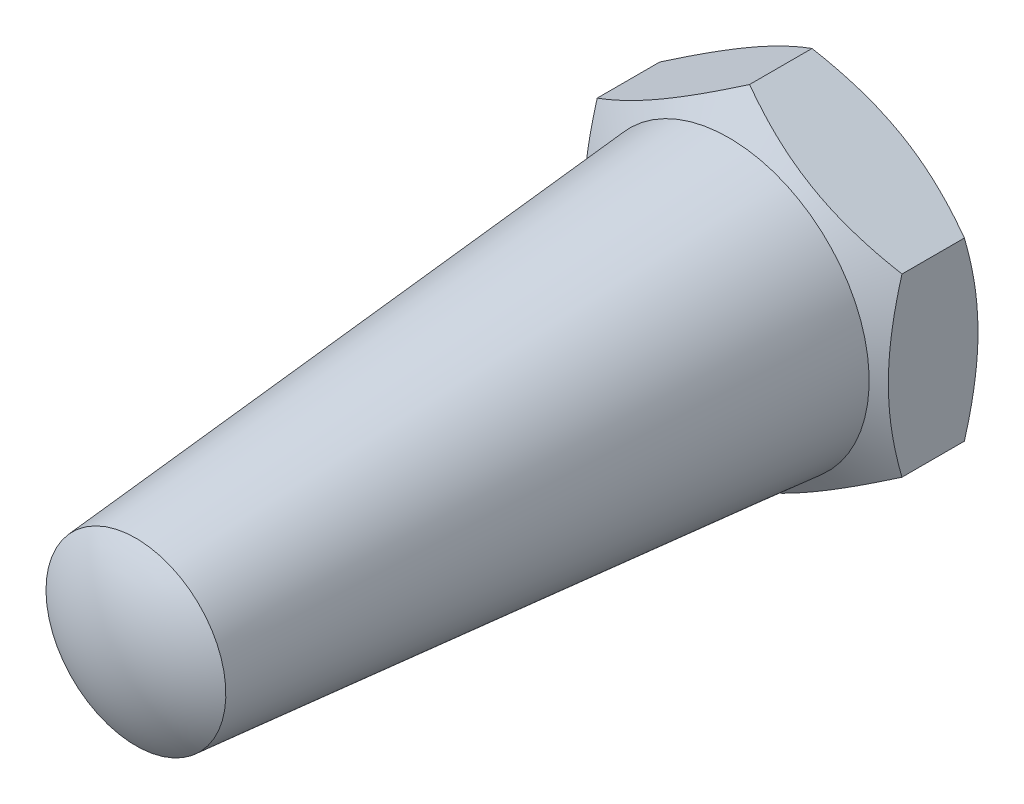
ISO-10303-21;
HEADER;
FILE_DESCRIPTION(('STEP AP214'),'2;1');
FILE_NAME('part.step','',(''),(''),'','','');
FILE_SCHEMA(('AUTOMOTIVE_DESIGN { 1 0 10303 214 1 1 1 1 }'));
ENDSEC;
DATA;
#1=APPLICATION_CONTEXT('core data for automotive mechanical design processes');
#2=APPLICATION_PROTOCOL_DEFINITION('international standard','automotive_design',2000,#1);
#3=PRODUCT_CONTEXT('',#1,'mechanical');
#4=PRODUCT('Part','Part','',(#3));
#5=PRODUCT_RELATED_PRODUCT_CATEGORY('part','',(#4));
#6=PRODUCT_DEFINITION_FORMATION('','',#4);
#7=PRODUCT_DEFINITION_CONTEXT('part definition',#1,'design');
#8=PRODUCT_DEFINITION('design','',#6,#7);
#9=PRODUCT_DEFINITION_SHAPE('','',#8);
#10=(LENGTH_UNIT() NAMED_UNIT(*) SI_UNIT(.MILLI.,.METRE.));
#11=(NAMED_UNIT(*) PLANE_ANGLE_UNIT() SI_UNIT($,.RADIAN.));
#12=(NAMED_UNIT(*) SI_UNIT($,.STERADIAN.) SOLID_ANGLE_UNIT());
#13=UNCERTAINTY_MEASURE_WITH_UNIT(LENGTH_MEASURE(1.E-05),#10,'distance_accuracy_value','');
#14=(GEOMETRIC_REPRESENTATION_CONTEXT(3) GLOBAL_UNCERTAINTY_ASSIGNED_CONTEXT((#13)) GLOBAL_UNIT_ASSIGNED_CONTEXT((#10,
#11,#12)) REPRESENTATION_CONTEXT('',''));
#15=CARTESIAN_POINT('',(0.,0.,0.));
#16=DIRECTION('',(0.,0.,1.));
#17=DIRECTION('',(1.,0.,0.));
#18=AXIS2_PLACEMENT_3D('',#15,#16,#17);
#19=CARTESIAN_POINT('',(0.,0.,0.));
#20=DIRECTION('',(0.,0.,1.));
#21=DIRECTION('',(-0.5,-0.866025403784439,0.));
#22=AXIS2_PLACEMENT_3D('',#19,#20,#21);
#23=CONICAL_SURFACE('',#22,8.5,1.04719755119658);
#24=CARTESIAN_POINT('',(-8.5,-4.90770822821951,0.759256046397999));
#25=CARTESIAN_POINT('',(-8.5,-4.69196487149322,0.696986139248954));
#26=CARTESIAN_POINT('',(-8.5,-4.47541714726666,0.637542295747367));
#27=CARTESIAN_POINT('',(-8.5,-4.04056304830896,0.52508511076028));
#28=CARTESIAN_POINT('',(-8.5,-3.82225595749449,0.472074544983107));
#29=CARTESIAN_POINT('',(-8.5,-3.1638393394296,0.32373338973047));
#30=CARTESIAN_POINT('',(-8.5,-2.72113075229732,0.239358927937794));
#31=CARTESIAN_POINT('',(-8.5,-2.05862591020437,0.140420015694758));
#32=CARTESIAN_POINT('',(-8.5,-1.84080885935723,0.112235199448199));
#33=CARTESIAN_POINT('',(-8.5,-1.40418973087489,0.0649740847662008));
#34=CARTESIAN_POINT('',(-8.5,-1.18538774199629,0.0458969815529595));
#35=CARTESIAN_POINT('',(-8.5,-0.747407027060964,0.0173347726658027));
#36=CARTESIAN_POINT('',(-8.5,-0.52822901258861,0.00783878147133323));
#37=CARTESIAN_POINT('',(-8.5,-0.0896705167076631,-0.00135762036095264));
#38=CARTESIAN_POINT('',(-8.5,0.129709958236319,-0.00105833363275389));
#39=CARTESIAN_POINT('',(-8.5,0.539849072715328,0.00865447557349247));
#40=CARTESIAN_POINT('',(-8.5,0.730636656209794,0.0168831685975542));
#41=CARTESIAN_POINT('',(-8.5,1.11176497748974,0.0405892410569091));
#42=CARTESIAN_POINT('',(-8.5,1.30210568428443,0.0560671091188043));
#43=CARTESIAN_POINT('',(-8.5,1.87239091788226,0.113008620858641));
#44=CARTESIAN_POINT('',(-8.5,2.25132599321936,0.164973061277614));
#45=CARTESIAN_POINT('',(-8.5,3.01321579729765,0.294884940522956));
#46=CARTESIAN_POINT('',(-8.5,3.39607329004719,0.373383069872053));
#47=CARTESIAN_POINT('',(-8.5,4.15607888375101,0.551541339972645));
#48=CARTESIAN_POINT('',(-8.5,4.53323671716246,0.651159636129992));
#49=CARTESIAN_POINT('',(-8.5,4.90770822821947,0.759256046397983));
#50=B_SPLINE_CURVE_WITH_KNOTS('',3,(#24,#25,#26,#27,#28,#29,#30,#31,#32,#33,#34,#35,#36,#37,#38,
#39,#40,#41,#42,#43,#44,#45,#46,#47,#48,#49),.UNSPECIFIED.,.F.,.F.,(4,2,2,2,2,2,2,2,2,2,2,2,4),
(0.,0.673596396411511,1.34748239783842,2.69805431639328,3.35679995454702,4.01548737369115,
4.67342558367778,5.33134346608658,5.90409556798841,6.47688628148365,7.62328361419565,
8.79510569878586,9.9646274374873),.UNSPECIFIED.);
#51=CARTESIAN_POINT('',(-8.5,0.,0.));
#52=VERTEX_POINT('',#51);
#53=CARTESIAN_POINT('',(-8.5,4.9074772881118,0.75918937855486));
#54=VERTEX_POINT('',#53);
#55=EDGE_CURVE('E144',#52,#54,#50,.T.);
#56=ORIENTED_EDGE('',*,*,#55,.T.);
#57=CARTESIAN_POINT('',(-8.5002,4.90736181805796,0.759256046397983));
#58=CARTESIAN_POINT('',(-8.31336077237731,5.01523349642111,0.696986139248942));
#59=CARTESIAN_POINT('',(-8.1258249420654,5.12350735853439,0.637542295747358));
#60=CARTESIAN_POINT('',(-7.74923024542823,5.34093440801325,0.525085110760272));
#61=CARTESIAN_POINT('',(-7.56017075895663,5.45008795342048,0.472074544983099));
#62=CARTESIAN_POINT('',(-6.98996524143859,5.77929626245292,0.32373338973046));
#63=CARTESIAN_POINT('',(-6.60656835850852,6.00065055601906,0.239358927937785));
#64=CARTESIAN_POINT('',(-6.03282233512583,6.33190297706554,0.140420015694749));
#65=CARTESIAN_POINT('',(-5.8441872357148,6.44081150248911,0.112235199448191));
#66=CARTESIAN_POINT('',(-5.46606397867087,6.65912106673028,0.0649740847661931));
#67=CARTESIAN_POINT('',(-5.27657589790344,6.76852206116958,0.0458969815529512));
#68=CARTESIAN_POINT('',(-4.89727347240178,6.98751241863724,0.0173347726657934));
#69=CARTESIAN_POINT('',(-4.70745974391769,7.09710142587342,0.00783878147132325));
#70=CARTESIAN_POINT('',(-4.32765694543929,7.31638067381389,-0.00135762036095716));
#71=CARTESIAN_POINT('',(-4.1376678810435,7.42607091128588,-0.00105833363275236));
#72=CARTESIAN_POINT('',(-3.78247698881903,7.63114046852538,0.00865447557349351));
#73=CARTESIAN_POINT('',(-3.61725009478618,7.72653426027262,0.0168831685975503));
#74=CARTESIAN_POINT('',(-3.28718328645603,7.9170984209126,0.0405892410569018));
#75=CARTESIAN_POINT('',(-3.12234339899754,8.01226877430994,0.0560671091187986));
#76=CARTESIAN_POINT('',(-2.62846189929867,8.29741139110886,0.113008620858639));
#77=CARTESIAN_POINT('',(-2.30029449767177,8.48687892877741,0.164973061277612));
#78=CARTESIAN_POINT('',(-1.64047857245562,8.86782383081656,0.294884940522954));
#79=CARTESIAN_POINT('',(-1.3089142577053,9.05925257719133,0.37338306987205));
#80=CARTESIAN_POINT('',(-0.650730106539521,9.43925537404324,0.551541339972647));
#81=CARTESIAN_POINT('',(-0.324101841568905,9.62783429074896,0.651159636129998));
#82=CARTESIAN_POINT('',(0.00020000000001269,9.81507004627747,0.759256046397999));
#83=B_SPLINE_CURVE_WITH_KNOTS('',3,(#57,#58,#59,#60,#61,#62,#63,#64,#65,#66,#67,#68,#69,#70,#71,
#72,#73,#74,#75,#76,#77,#78,#79,#80,#81,#82),.UNSPECIFIED.,.F.,.F.,(4,2,2,2,2,2,2,2,2,2,2,2,4),
(0.,0.673596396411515,1.34748239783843,2.69805431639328,3.35679995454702,4.01548737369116,
4.67342558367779,5.33134346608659,5.90409556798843,6.47688628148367,7.62328361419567,
8.79510569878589,9.96462743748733),.UNSPECIFIED.);
#84=CARTESIAN_POINT('',(-4.25,7.36121593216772,0.));
#85=VERTEX_POINT('',#84);
#86=EDGE_CURVE('E96',#54,#85,#83,.T.);
#87=ORIENTED_EDGE('',*,*,#86,.T.);
#88=CARTESIAN_POINT('',(0.,0.,0.));
#89=DIRECTION('',(0.,0.,-1.));
#90=DIRECTION('',(0.5,0.866025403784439,0.));
#91=AXIS2_PLACEMENT_3D('',#88,#89,#90);
#92=CIRCLE('',#91,8.5);
#93=EDGE_CURVE('E107',#52,#85,#92,.T.);
#94=ORIENTED_EDGE('',*,*,#93,.F.);
#95=EDGE_LOOP('',(#56,#87,#94));
#96=FACE_BOUND('',#95,.T.);
#97=ADVANCED_FACE('F14',(#96),#23,.T.);
#98=CARTESIAN_POINT('',(4.25,7.36121593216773,0.));
#99=VERTEX_POINT('',#98);
#100=EDGE_CURVE('E104',#85,#99,#92,.T.);
#101=ORIENTED_EDGE('',*,*,#100,.F.);
#102=CARTESIAN_POINT('',(0.,9.81495457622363,0.759189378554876));
#103=VERTEX_POINT('',#102);
#104=EDGE_CURVE('E110',#85,#103,#83,.T.);
#105=ORIENTED_EDGE('',*,*,#104,.T.);
#106=CARTESIAN_POINT('',(-7.23207771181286,13.9903965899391,4.18526972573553));
#107=CARTESIAN_POINT('',(-6.91001284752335,13.804452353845,4.00456511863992));
#108=CARTESIAN_POINT('',(-6.58721574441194,13.61808535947,3.82557120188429));
#109=CARTESIAN_POINT('',(-5.93976791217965,13.2442811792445,3.47196532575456));
#110=CARTESIAN_POINT('',(-5.61511690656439,13.0568438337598,3.29735404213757));
#111=CARTESIAN_POINT('',(-4.96193081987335,12.6797266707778,2.95261175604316));
#112=CARTESIAN_POINT('',(-4.63338425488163,12.4900402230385,2.7825096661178));
#113=CARTESIAN_POINT('',(-3.97370116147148,12.1091720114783,2.44916508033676));
#114=CARTESIAN_POINT('',(-3.6425647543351,11.9179903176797,2.28592226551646));
#115=CARTESIAN_POINT('',(-2.96621852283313,11.5275016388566,1.96287121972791));
#116=CARTESIAN_POINT('',(-2.6209042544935,11.3281343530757,1.80335295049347));
#117=CARTESIAN_POINT('',(-1.92626102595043,10.9270818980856,1.49620558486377));
#118=CARTESIAN_POINT('',(-1.57693162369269,10.7253964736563,1.34857781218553));
#119=CARTESIAN_POINT('',(-0.874330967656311,10.3197497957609,1.06903165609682));
#120=CARTESIAN_POINT('',(-0.521069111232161,10.11579396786,0.937082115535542));
#121=CARTESIAN_POINT('',(0.19050935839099,9.70496394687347,0.693074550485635));
#122=CARTESIAN_POINT('',(0.548824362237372,9.49809068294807,0.581010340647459));
#123=CARTESIAN_POINT('',(1.26876054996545,9.08243533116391,0.382710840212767));
#124=CARTESIAN_POINT('',(1.63035127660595,8.87367082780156,0.296332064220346));
#125=CARTESIAN_POINT('',(2.17608252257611,8.5585927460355,0.189725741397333));
#126=CARTESIAN_POINT('',(2.35856341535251,8.45323735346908,0.158015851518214));
#127=CARTESIAN_POINT('',(2.72445452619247,8.24199002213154,0.102870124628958));
#128=CARTESIAN_POINT('',(2.90786465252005,8.13609813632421,0.0794334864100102));
#129=CARTESIAN_POINT('',(3.27294381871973,7.9253195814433,0.0415991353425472));
#130=CARTESIAN_POINT('',(3.45460386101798,7.8204381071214,0.0270861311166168));
#131=CARTESIAN_POINT('',(3.81829287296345,7.61046215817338,0.00694756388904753));
#132=CARTESIAN_POINT('',(4.00032183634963,7.50536768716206,0.00132185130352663));
#133=CARTESIAN_POINT('',(4.36442256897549,7.29515403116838,-0.000907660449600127));
#134=CARTESIAN_POINT('',(4.54649433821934,7.19003484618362,0.00248854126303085));
#135=CARTESIAN_POINT('',(4.91035029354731,6.97996251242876,0.0182187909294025));
#136=CARTESIAN_POINT('',(5.09213446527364,6.87500937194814,0.0305532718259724));
#137=CARTESIAN_POINT('',(5.52703745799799,6.62391801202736,0.070491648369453));
#138=CARTESIAN_POINT('',(5.77987910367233,6.47793981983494,0.102209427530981));
#139=CARTESIAN_POINT('',(6.28371702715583,6.18704885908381,0.181223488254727));
#140=CARTESIAN_POINT('',(6.5347130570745,6.04213623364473,0.22852182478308));
#141=CARTESIAN_POINT('',(7.28462915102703,5.6091719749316,0.391282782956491));
#142=CARTESIAN_POINT('',(7.78020394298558,5.32305173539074,0.527582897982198));
#143=CARTESIAN_POINT('',(8.52128703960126,4.8951872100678,0.76439975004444));
#144=CARTESIAN_POINT('',(8.77062907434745,4.7512295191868,0.849844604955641));
#145=CARTESIAN_POINT('',(9.26689247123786,4.46471171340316,1.02972598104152));
#146=CARTESIAN_POINT('',(9.51381381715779,4.32215160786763,1.1241625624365));
#147=CARTESIAN_POINT('',(10.0053112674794,4.03838542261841,1.32050253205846));
#148=CARTESIAN_POINT('',(10.2498880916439,3.89717892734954,1.42240353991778));
#149=CARTESIAN_POINT('',(10.7370088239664,3.61593964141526,1.63246178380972));
#150=CARTESIAN_POINT('',(10.9795527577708,3.47590683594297,1.74061894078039));
#151=CARTESIAN_POINT('',(11.5588292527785,3.14146139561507,2.00615790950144));
#152=CARTESIAN_POINT('',(11.8947051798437,2.94754333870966,2.16602701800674));
#153=CARTESIAN_POINT('',(12.5635309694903,2.56139658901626,2.49375196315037));
#154=CARTESIAN_POINT('',(12.8964806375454,2.36916800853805,2.66160832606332));
#155=CARTESIAN_POINT('',(13.5600092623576,1.9860795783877,3.00368299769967));
#156=CARTESIAN_POINT('',(13.890587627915,1.79522007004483,3.17790283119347));
#157=CARTESIAN_POINT('',(14.5496956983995,1.41468384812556,3.53139949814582));
#158=CARTESIAN_POINT('',(14.8782254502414,1.22500710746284,3.71067621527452));
#159=CARTESIAN_POINT('',(15.5339610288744,0.846417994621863,4.07353479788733));
#160=CARTESIAN_POINT('',(15.8611648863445,0.657506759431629,4.2571214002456));
#161=CARTESIAN_POINT('',(16.5141402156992,0.280511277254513,4.62765894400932));
#162=CARTESIAN_POINT('',(16.8399116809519,0.0924270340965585,4.81460990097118));
#163=CARTESIAN_POINT('',(17.8153349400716,-0.47073384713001,5.37954999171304));
#164=CARTESIAN_POINT('',(18.4631885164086,-0.844772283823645,5.76167820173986));
#165=CARTESIAN_POINT('',(19.6998458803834,-1.55875674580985,6.50045352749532));
#166=CARTESIAN_POINT('',(20.2889356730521,-1.89886789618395,6.85646521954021));
#167=CARTESIAN_POINT('',(21.4649231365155,-2.57782457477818,7.57334253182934));
#168=CARTESIAN_POINT('',(22.0518207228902,-2.91667005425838,7.9342083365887));
#169=CARTESIAN_POINT('',(23.2223733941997,-3.59248895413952,8.65867559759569));
#170=CARTESIAN_POINT('',(23.8060329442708,-3.92946495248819,9.02226745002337));
#171=CARTESIAN_POINT('',(24.9719543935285,-4.60261001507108,9.75233522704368));
#172=CARTESIAN_POINT('',(25.554216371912,-4.93877912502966,10.1188109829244));
#173=CARTESIAN_POINT('',(26.1359662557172,-5.27465257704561,10.4863601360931));
#174=B_SPLINE_CURVE_WITH_KNOTS('',3,(#106,#107,#108,#109,#110,#111,#112,#113,#114,#115,#116,
#117,#118,#119,#120,#121,#122,#123,#124,#125,#126,#127,#128,#129,#130,#131,#132,#133,#134,#135,
#136,#137,#138,#139,#140,#141,#142,#143,#144,#145,#146,#147,#148,#149,#150,#151,#152,#153,#154,
#155,#156,#157,#158,#159,#160,#161,#162,#163,#164,#165,#166,#167,#168,#169,#170,#171,#172,#173),
.UNSPECIFIED.,.F.,.F.,(4,2,2,2,2,2,2,2,2,2,2,2,2,2,2,2,2,2,2,2,2,2,2,2,2,2,2,2,2,2,2,2,2,4),(0.,
1.24041661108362,2.4810233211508,3.72825657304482,4.97543176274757,6.26366261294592,
7.55203667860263,8.83780596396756,10.1231746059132,11.4012218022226,12.0403353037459,
12.6793868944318,13.3099983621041,13.9405992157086,14.5712001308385,15.2018315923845,
16.0823582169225,16.9630010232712,18.725232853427,19.6261358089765,20.5270447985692,
21.4276677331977,22.3282792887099,23.586638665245,24.8450810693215,26.1038270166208,
27.3625440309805,28.6227160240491,29.8828938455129,32.402892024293,34.7061342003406,
37.0094641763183,39.306779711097,41.6039618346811),.UNSPECIFIED.);
#175=EDGE_CURVE('E182',#103,#99,#174,.T.);
#176=ORIENTED_EDGE('',*,*,#175,.T.);
#177=EDGE_LOOP('',(#101,#105,#176));
#178=FACE_BOUND('',#177,.T.);
#179=ADVANCED_FACE('F139',(#178),#23,.T.);
#180=CARTESIAN_POINT('',(8.5,0.,0.));
#181=VERTEX_POINT('',#180);
#182=EDGE_CURVE('E109',#99,#181,#92,.T.);
#183=ORIENTED_EDGE('',*,*,#182,.F.);
#184=CARTESIAN_POINT('',(8.5,4.90747728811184,0.759189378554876));
#185=VERTEX_POINT('',#184);
#186=EDGE_CURVE('E175',#99,#185,#174,.T.);
#187=ORIENTED_EDGE('',*,*,#186,.T.);
#188=CARTESIAN_POINT('',(8.5,4.90770822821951,0.759256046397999));
#189=CARTESIAN_POINT('',(8.5,4.69196487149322,0.696986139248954));
#190=CARTESIAN_POINT('',(8.5,4.47541714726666,0.637542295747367));
#191=CARTESIAN_POINT('',(8.5,4.04056304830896,0.52508511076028));
#192=CARTESIAN_POINT('',(8.5,3.82225595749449,0.472074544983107));
#193=CARTESIAN_POINT('',(8.5,3.1638393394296,0.32373338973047));
#194=CARTESIAN_POINT('',(8.5,2.72113075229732,0.239358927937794));
#195=CARTESIAN_POINT('',(8.5,2.05862591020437,0.140420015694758));
#196=CARTESIAN_POINT('',(8.5,1.84080885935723,0.112235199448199));
#197=CARTESIAN_POINT('',(8.5,1.40418973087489,0.0649740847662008));
#198=CARTESIAN_POINT('',(8.5,1.18538774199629,0.0458969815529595));
#199=CARTESIAN_POINT('',(8.5,0.747407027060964,0.0173347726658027));
#200=CARTESIAN_POINT('',(8.5,0.52822901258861,0.00783878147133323));
#201=CARTESIAN_POINT('',(8.5,0.0896705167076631,-0.00135762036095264));
#202=CARTESIAN_POINT('',(8.5,-0.129709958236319,-0.00105833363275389));
#203=CARTESIAN_POINT('',(8.5,-0.539849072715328,0.00865447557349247));
#204=CARTESIAN_POINT('',(8.5,-0.730636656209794,0.0168831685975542));
#205=CARTESIAN_POINT('',(8.5,-1.11176497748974,0.0405892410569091));
#206=CARTESIAN_POINT('',(8.5,-1.30210568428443,0.0560671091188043));
#207=CARTESIAN_POINT('',(8.5,-1.87239091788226,0.113008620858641));
#208=CARTESIAN_POINT('',(8.5,-2.25132599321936,0.164973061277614));
#209=CARTESIAN_POINT('',(8.5,-3.01321579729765,0.294884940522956));
#210=CARTESIAN_POINT('',(8.5,-3.39607329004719,0.373383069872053));
#211=CARTESIAN_POINT('',(8.5,-4.15607888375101,0.551541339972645));
#212=CARTESIAN_POINT('',(8.5,-4.53323671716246,0.651159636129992));
#213=CARTESIAN_POINT('',(8.5,-4.90770822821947,0.759256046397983));
#214=B_SPLINE_CURVE_WITH_KNOTS('',3,(#188,#189,#190,#191,#192,#193,#194,#195,#196,#197,#198,
#199,#200,#201,#202,#203,#204,#205,#206,#207,#208,#209,#210,#211,#212,#213),.UNSPECIFIED.,.F.,
.F.,(4,2,2,2,2,2,2,2,2,2,2,2,4),(0.,0.673596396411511,1.34748239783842,2.69805431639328,
3.35679995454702,4.01548737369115,4.67342558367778,5.33134346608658,5.90409556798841,
6.47688628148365,7.62328361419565,8.79510569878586,9.9646274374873),.UNSPECIFIED.);
#215=EDGE_CURVE('E219',#185,#181,#214,.T.);
#216=ORIENTED_EDGE('',*,*,#215,.T.);
#217=EDGE_LOOP('',(#183,#187,#216));
#218=FACE_BOUND('',#217,.T.);
#219=ADVANCED_FACE('F282',(#218),#23,.T.);
#220=CARTESIAN_POINT('',(4.25,-7.36121593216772,0.));
#221=VERTEX_POINT('',#220);
#222=EDGE_CURVE('E271',#181,#221,#92,.T.);
#223=ORIENTED_EDGE('',*,*,#222,.F.);
#224=CARTESIAN_POINT('',(8.5,-4.9074772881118,0.75918937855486));
#225=VERTEX_POINT('',#224);
#226=EDGE_CURVE('E167',#181,#225,#214,.T.);
#227=ORIENTED_EDGE('',*,*,#226,.T.);
#228=CARTESIAN_POINT('',(8.5002,-4.90736181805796,0.759256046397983));
#229=CARTESIAN_POINT('',(8.31336077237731,-5.01523349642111,0.696986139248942));
#230=CARTESIAN_POINT('',(8.1258249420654,-5.12350735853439,0.637542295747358));
#231=CARTESIAN_POINT('',(7.74923024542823,-5.34093440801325,0.525085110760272));
#232=CARTESIAN_POINT('',(7.56017075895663,-5.45008795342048,0.472074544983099));
#233=CARTESIAN_POINT('',(6.98996524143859,-5.77929626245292,0.32373338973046));
#234=CARTESIAN_POINT('',(6.60656835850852,-6.00065055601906,0.239358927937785));
#235=CARTESIAN_POINT('',(6.03282233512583,-6.33190297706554,0.140420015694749));
#236=CARTESIAN_POINT('',(5.8441872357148,-6.44081150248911,0.112235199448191));
#237=CARTESIAN_POINT('',(5.46606397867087,-6.65912106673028,0.0649740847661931));
#238=CARTESIAN_POINT('',(5.27657589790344,-6.76852206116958,0.0458969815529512));
#239=CARTESIAN_POINT('',(4.89727347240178,-6.98751241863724,0.0173347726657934));
#240=CARTESIAN_POINT('',(4.70745974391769,-7.09710142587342,0.00783878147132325));
#241=CARTESIAN_POINT('',(4.32765694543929,-7.31638067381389,-0.00135762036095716));
#242=CARTESIAN_POINT('',(4.1376678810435,-7.42607091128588,-0.00105833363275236));
#243=CARTESIAN_POINT('',(3.78247698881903,-7.63114046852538,0.00865447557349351));
#244=CARTESIAN_POINT('',(3.61725009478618,-7.72653426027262,0.0168831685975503));
#245=CARTESIAN_POINT('',(3.28718328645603,-7.9170984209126,0.0405892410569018));
#246=CARTESIAN_POINT('',(3.12234339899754,-8.01226877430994,0.0560671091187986));
#247=CARTESIAN_POINT('',(2.62846189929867,-8.29741139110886,0.113008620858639));
#248=CARTESIAN_POINT('',(2.30029449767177,-8.48687892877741,0.164973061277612));
#249=CARTESIAN_POINT('',(1.64047857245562,-8.86782383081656,0.294884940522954));
#250=CARTESIAN_POINT('',(1.3089142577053,-9.05925257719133,0.37338306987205));
#251=CARTESIAN_POINT('',(0.650730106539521,-9.43925537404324,0.551541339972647));
#252=CARTESIAN_POINT('',(0.324101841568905,-9.62783429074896,0.651159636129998));
#253=CARTESIAN_POINT('',(-0.00020000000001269,-9.81507004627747,0.759256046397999));
#254=B_SPLINE_CURVE_WITH_KNOTS('',3,(#228,#229,#230,#231,#232,#233,#234,#235,#236,#237,#238,
#239,#240,#241,#242,#243,#244,#245,#246,#247,#248,#249,#250,#251,#252,#253),.UNSPECIFIED.,.F.,
.F.,(4,2,2,2,2,2,2,2,2,2,2,2,4),(0.,0.673596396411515,1.34748239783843,2.69805431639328,
3.35679995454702,4.01548737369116,4.67342558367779,5.33134346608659,5.90409556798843,
6.47688628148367,7.62328361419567,8.79510569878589,9.96462743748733),.UNSPECIFIED.);
#255=EDGE_CURVE('E217',#225,#221,#254,.T.);
#256=ORIENTED_EDGE('',*,*,#255,.T.);
#257=EDGE_LOOP('',(#223,#227,#256));
#258=FACE_BOUND('',#257,.T.);
#259=ADVANCED_FACE('F283',(#258),#23,.T.);
#260=CARTESIAN_POINT('',(-4.25,-7.36121593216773,0.));
#261=VERTEX_POINT('',#260);
#262=EDGE_CURVE('E277',#221,#261,#92,.T.);
#263=ORIENTED_EDGE('',*,*,#262,.F.);
#264=CARTESIAN_POINT('',(0.,-9.81495457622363,0.759189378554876));
#265=VERTEX_POINT('',#264);
#266=EDGE_CURVE('E159',#221,#265,#254,.T.);
#267=ORIENTED_EDGE('',*,*,#266,.T.);
#268=CARTESIAN_POINT('',(-15.7320777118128,-0.73203527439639,4.18526972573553));
#269=CARTESIAN_POINT('',(-15.4100128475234,-0.917979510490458,4.00456511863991));
#270=CARTESIAN_POINT('',(-15.0872157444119,-1.10434650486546,3.82557120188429));
#271=CARTESIAN_POINT('',(-14.4397679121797,-1.47815068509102,3.47196532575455));
#272=CARTESIAN_POINT('',(-14.1151169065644,-1.66558803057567,3.29735404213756));
#273=CARTESIAN_POINT('',(-13.4619308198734,-2.04270519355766,2.95261175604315));
#274=CARTESIAN_POINT('',(-13.1333842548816,-2.23239164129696,2.78250966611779));
#275=CARTESIAN_POINT('',(-12.4737011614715,-2.61325985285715,2.44916508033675));
#276=CARTESIAN_POINT('',(-12.1425647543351,-2.80444154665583,2.28592226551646));
#277=CARTESIAN_POINT('',(-11.4662185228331,-3.19493022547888,1.96287121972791));
#278=CARTESIAN_POINT('',(-11.1209042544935,-3.39429751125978,1.80335295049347));
#279=CARTESIAN_POINT('',(-10.4262610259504,-3.79534996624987,1.49620558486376));
#280=CARTESIAN_POINT('',(-10.0769316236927,-3.99703539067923,1.34857781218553));
#281=CARTESIAN_POINT('',(-9.37433096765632,-4.40268206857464,1.06903165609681));
#282=CARTESIAN_POINT('',(-9.02106911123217,-4.60663789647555,0.937082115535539));
#283=CARTESIAN_POINT('',(-8.30949064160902,-5.01746791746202,0.693074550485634));
#284=CARTESIAN_POINT('',(-7.95117563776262,-5.2243411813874,0.581010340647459));
#285=CARTESIAN_POINT('',(-7.23123945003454,-5.63999653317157,0.382710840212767));
#286=CARTESIAN_POINT('',(-6.86964872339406,-5.84876103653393,0.296332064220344));
#287=CARTESIAN_POINT('',(-6.3239174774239,-6.16383911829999,0.18972574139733));
#288=CARTESIAN_POINT('',(-6.1414365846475,-6.26919451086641,0.158015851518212));
#289=CARTESIAN_POINT('',(-5.77554547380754,-6.48044184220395,0.102870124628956));
#290=CARTESIAN_POINT('',(-5.59213534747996,-6.58633372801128,0.0794334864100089));
#291=CARTESIAN_POINT('',(-5.22705618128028,-6.7971122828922,0.0415991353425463));
#292=CARTESIAN_POINT('',(-5.04539613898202,-6.90199375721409,0.0270861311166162));
#293=CARTESIAN_POINT('',(-4.68170712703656,-7.11196970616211,0.00694756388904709));
#294=CARTESIAN_POINT('',(-4.49967816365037,-7.21706417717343,0.00132185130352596));
#295=CARTESIAN_POINT('',(-4.13557743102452,-7.42727783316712,-0.00090766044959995));
#296=CARTESIAN_POINT('',(-3.95350566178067,-7.53239701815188,0.00248854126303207));
#297=CARTESIAN_POINT('',(-3.58964970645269,-7.74246935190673,0.0182187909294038));
#298=CARTESIAN_POINT('',(-3.40786553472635,-7.84742249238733,0.0305532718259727));
#299=CARTESIAN_POINT('',(-2.972962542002,-8.0985138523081,0.0704916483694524));
#300=CARTESIAN_POINT('',(-2.72012089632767,-8.24449204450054,0.102209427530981));
#301=CARTESIAN_POINT('',(-2.21628297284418,-8.53538300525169,0.181223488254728));
#302=CARTESIAN_POINT('',(-1.96528694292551,-8.68029563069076,0.228521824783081));
#303=CARTESIAN_POINT('',(-1.21537084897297,-9.11325988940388,0.391282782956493));
#304=CARTESIAN_POINT('',(-0.71979605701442,-9.39938012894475,0.5275828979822));
#305=CARTESIAN_POINT('',(0.0212870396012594,-9.8272446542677,0.764399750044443));
#306=CARTESIAN_POINT('',(0.270629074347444,-9.9712023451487,0.849844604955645));
#307=CARTESIAN_POINT('',(0.76689247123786,-10.2577201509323,1.02972598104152));
#308=CARTESIAN_POINT('',(1.01381381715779,-10.4002802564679,1.12416256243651));
#309=CARTESIAN_POINT('',(1.50531126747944,-10.6840464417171,1.32050253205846));
#310=CARTESIAN_POINT('',(1.74988809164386,-10.825252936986,1.42240353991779));
#311=CARTESIAN_POINT('',(2.23700882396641,-11.1064922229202,1.63246178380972));
#312=CARTESIAN_POINT('',(2.47955275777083,-11.2465250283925,1.74061894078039));
#313=CARTESIAN_POINT('',(3.05882925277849,-11.5809704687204,2.00615790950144));
#314=CARTESIAN_POINT('',(3.3947051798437,-11.7748885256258,2.16602701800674));
#315=CARTESIAN_POINT('',(4.06353096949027,-12.1610352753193,2.49375196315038));
#316=CARTESIAN_POINT('',(4.39648063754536,-12.3532638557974,2.66160832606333));
#317=CARTESIAN_POINT('',(5.06000926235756,-12.7363522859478,3.00368299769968));
#318=CARTESIAN_POINT('',(5.39058762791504,-12.9272117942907,3.17790283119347));
#319=CARTESIAN_POINT('',(6.04969569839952,-13.3077480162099,3.53139949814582));
#320=CARTESIAN_POINT('',(6.37822545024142,-13.4974247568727,3.71067621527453));
#321=CARTESIAN_POINT('',(7.03396102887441,-13.8760138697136,4.07353479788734));
#322=CARTESIAN_POINT('',(7.36116488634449,-14.0649251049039,4.2571214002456));
#323=CARTESIAN_POINT('',(8.01414021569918,-14.441920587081,4.62765894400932));
#324=CARTESIAN_POINT('',(8.33991168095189,-14.6300048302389,4.81460990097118));
#325=CARTESIAN_POINT('',(9.31533494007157,-15.1931657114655,5.37954999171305));
#326=CARTESIAN_POINT('',(9.96318851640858,-15.5672041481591,5.76167820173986));
#327=CARTESIAN_POINT('',(11.1998458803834,-16.2811886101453,6.50045352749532));
#328=CARTESIAN_POINT('',(11.788935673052,-16.6212997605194,6.85646521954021));
#329=CARTESIAN_POINT('',(12.9649231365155,-17.3002564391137,7.57334253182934));
#330=CARTESIAN_POINT('',(13.5518207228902,-17.6391019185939,7.9342083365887));
#331=CARTESIAN_POINT('',(14.7223733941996,-18.314920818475,8.65867559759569));
#332=CARTESIAN_POINT('',(15.3060329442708,-18.6518968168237,9.02226745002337));
#333=CARTESIAN_POINT('',(16.4719543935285,-19.3250418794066,9.75233522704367));
#334=CARTESIAN_POINT('',(17.054216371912,-19.6612109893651,10.1188109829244));
#335=CARTESIAN_POINT('',(17.6359662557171,-19.9970844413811,10.4863601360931));
#336=B_SPLINE_CURVE_WITH_KNOTS('',3,(#268,#269,#270,#271,#272,#273,#274,#275,#276,#277,#278,
#279,#280,#281,#282,#283,#284,#285,#286,#287,#288,#289,#290,#291,#292,#293,#294,#295,#296,#297,
#298,#299,#300,#301,#302,#303,#304,#305,#306,#307,#308,#309,#310,#311,#312,#313,#314,#315,#316,
#317,#318,#319,#320,#321,#322,#323,#324,#325,#326,#327,#328,#329,#330,#331,#332,#333,#334,#335),
.UNSPECIFIED.,.F.,.F.,(4,2,2,2,2,2,2,2,2,2,2,2,2,2,2,2,2,2,2,2,2,2,2,2,2,2,2,2,2,2,2,2,2,4),(0.,
1.24041661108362,2.4810233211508,3.72825657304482,4.97543176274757,6.26366261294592,
7.55203667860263,8.83780596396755,10.1231746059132,11.4012218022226,12.0403353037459,
12.6793868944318,13.3099983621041,13.9405992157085,14.5712001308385,15.2018315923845,
16.0823582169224,16.9630010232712,18.725232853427,19.6261358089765,20.5270447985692,
21.4276677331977,22.3282792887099,23.586638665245,24.8450810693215,26.1038270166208,
27.3625440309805,28.6227160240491,29.8828938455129,32.402892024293,34.7061342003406,
37.0094641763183,39.306779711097,41.603961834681),.UNSPECIFIED.);
#337=EDGE_CURVE('E228',#265,#261,#336,.F.);
#338=ORIENTED_EDGE('',*,*,#337,.T.);
#339=EDGE_LOOP('',(#263,#267,#338));
#340=FACE_BOUND('',#339,.T.);
#341=ADVANCED_FACE('F286',(#340),#23,.T.);
#342=EDGE_CURVE('E239',#261,#52,#92,.T.);
#343=ORIENTED_EDGE('',*,*,#342,.F.);
#344=CARTESIAN_POINT('',(-8.5,-4.90747728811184,0.759189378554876));
#345=VERTEX_POINT('',#344);
#346=EDGE_CURVE('E87',#261,#345,#336,.F.);
#347=ORIENTED_EDGE('',*,*,#346,.T.);
#348=EDGE_CURVE('E88',#345,#52,#50,.T.);
#349=ORIENTED_EDGE('',*,*,#348,.T.);
#350=EDGE_LOOP('',(#343,#347,#349));
#351=FACE_BOUND('',#350,.T.);
#352=ADVANCED_FACE('F135',(#351),#23,.T.);
#353=CARTESIAN_POINT('',(7.36121593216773,-4.25,0.));
#354=DIRECTION('',(0.,0.,-1.));
#355=DIRECTION('',(0.5,0.866025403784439,0.));
#356=AXIS2_PLACEMENT_3D('',#353,#354,#355);
#357=PLANE('',#356);
#358=CARTESIAN_POINT('',(0.,0.,0.));
#359=DIRECTION('',(0.,0.,-1.));
#360=DIRECTION('',(-0.866025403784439,0.5,0.));
#361=AXIS2_PLACEMENT_3D('',#358,#359,#360);
#362=CIRCLE('',#361,5.);
#363=CARTESIAN_POINT('',(-4.3301270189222,2.5,0.));
#364=VERTEX_POINT('',#363);
#365=EDGE_CURVE('E256',#364,#364,#362,.T.);
#366=ORIENTED_EDGE('',*,*,#365,.F.);
#367=EDGE_LOOP('',(#366));
#368=FACE_BOUND('',#367,.T.);
#369=ORIENTED_EDGE('',*,*,#182,.T.);
#370=ORIENTED_EDGE('',*,*,#222,.T.);
#371=ORIENTED_EDGE('',*,*,#262,.T.);
#372=ORIENTED_EDGE('',*,*,#342,.T.);
#373=ORIENTED_EDGE('',*,*,#93,.T.);
#374=ORIENTED_EDGE('',*,*,#100,.T.);
#375=EDGE_LOOP('',(#369,#370,#371,#372,#373,#374));
#376=FACE_BOUND('',#375,.T.);
#377=ADVANCED_FACE('F130',(#368,#376),#357,.T.);
#378=CARTESIAN_POINT('',(0.,9.81495457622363,-40.));
#379=DIRECTION('',(-0.5,0.866025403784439,0.));
#380=DIRECTION('',(-0.866025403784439,-0.5,0.));
#381=AXIS2_PLACEMENT_3D('',#378,#379,#380);
#382=PLANE('',#381);
#383=DIRECTION('',(0.,0.,1.));
#384=VECTOR('',#383,1.);
#385=CARTESIAN_POINT('',(0.,9.81495457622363,-40.));
#386=LINE('',#385,#384);
#387=CARTESIAN_POINT('',(0.,9.81495457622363,4.24081062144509));
#388=VERTEX_POINT('',#387);
#389=EDGE_CURVE('E254',#103,#388,#386,.T.);
#390=ORIENTED_EDGE('',*,*,#389,.F.);
#391=ORIENTED_EDGE('',*,*,#104,.F.);
#392=ORIENTED_EDGE('',*,*,#86,.F.);
#393=DIRECTION('',(0.,0.,1.));
#394=VECTOR('',#393,1.);
#395=CARTESIAN_POINT('',(-8.5,4.9074772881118,-40.));
#396=LINE('',#395,#394);
#397=CARTESIAN_POINT('',(-8.5,4.9074772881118,4.2408106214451));
#398=VERTEX_POINT('',#397);
#399=EDGE_CURVE('E35',#54,#398,#396,.T.);
#400=ORIENTED_EDGE('',*,*,#399,.T.);
#401=CARTESIAN_POINT('',(0.00020000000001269,9.81507004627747,4.24074395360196));
#402=CARTESIAN_POINT('',(-0.186639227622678,9.70719836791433,4.30301386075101));
#403=CARTESIAN_POINT('',(-0.374175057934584,9.59892450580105,4.3624577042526));
#404=CARTESIAN_POINT('',(-0.750769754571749,9.38149745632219,4.47491488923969));
#405=CARTESIAN_POINT('',(-0.939829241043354,9.27234391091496,4.52792545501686));
#406=CARTESIAN_POINT('',(-1.51003475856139,8.94313560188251,4.67626661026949));
#407=CARTESIAN_POINT('',(-1.89343164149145,8.72178130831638,4.76064107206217));
#408=CARTESIAN_POINT('',(-2.46717766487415,8.3905288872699,4.8595799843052));
#409=CARTESIAN_POINT('',(-2.65581276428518,8.28162036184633,4.88776480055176));
#410=CARTESIAN_POINT('',(-3.0339360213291,8.06331079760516,4.93502591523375));
#411=CARTESIAN_POINT('',(-3.22342410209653,7.95390980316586,4.95410301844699));
#412=CARTESIAN_POINT('',(-3.60272652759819,7.7349194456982,4.98266522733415));
#413=CARTESIAN_POINT('',(-3.79254025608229,7.62533043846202,4.99216121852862));
#414=CARTESIAN_POINT('',(-4.17234305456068,7.40605119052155,5.0013576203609));
#415=CARTESIAN_POINT('',(-4.36233211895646,7.29636095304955,5.0010583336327));
#416=CARTESIAN_POINT('',(-4.71752301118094,7.09129139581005,4.99134552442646));
#417=CARTESIAN_POINT('',(-4.88274990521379,6.99589760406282,4.9831168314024));
#418=CARTESIAN_POINT('',(-5.21281671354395,6.80533344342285,4.95941075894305));
#419=CARTESIAN_POINT('',(-5.37765660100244,6.7101630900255,4.94393289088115));
#420=CARTESIAN_POINT('',(-5.87153810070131,6.42502047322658,4.88699137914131));
#421=CARTESIAN_POINT('',(-6.19970550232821,6.23555293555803,4.83502693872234));
#422=CARTESIAN_POINT('',(-6.85952142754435,5.85460803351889,4.705115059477));
#423=CARTESIAN_POINT('',(-7.19108574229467,5.66317928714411,4.6266169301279));
#424=CARTESIAN_POINT('',(-7.84926989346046,5.2831764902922,4.44845866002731));
#425=CARTESIAN_POINT('',(-8.17589815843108,5.09459757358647,4.34884036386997));
#426=CARTESIAN_POINT('',(-8.5002,4.90736181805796,4.24074395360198));
#427=B_SPLINE_CURVE_WITH_KNOTS('',3,(#401,#402,#403,#404,#405,#406,#407,#408,#409,#410,#411,
#412,#413,#414,#415,#416,#417,#418,#419,#420,#421,#422,#423,#424,#425,#426),.UNSPECIFIED.,.F.,
.F.,(4,2,2,2,2,2,2,2,2,2,2,2,4),(0.,0.673596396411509,1.34748239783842,2.69805431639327,
3.35679995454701,4.01548737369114,4.67342558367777,5.33134346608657,5.90409556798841,
6.47688628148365,7.62328361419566,8.79510569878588,9.96462743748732),.UNSPECIFIED.);
#428=EDGE_CURVE('E93',#388,#398,#427,.T.);
#429=ORIENTED_EDGE('',*,*,#428,.F.);
#430=EDGE_LOOP('',(#390,#391,#392,#400,#429));
#431=FACE_BOUND('',#430,.T.);
#432=ADVANCED_FACE('F92',(#431),#382,.T.);
#433=CARTESIAN_POINT('',(8.5,4.90747728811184,-40.));
#434=DIRECTION('',(0.5,0.866025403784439,0.));
#435=DIRECTION('',(-0.866025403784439,0.5,0.));
#436=AXIS2_PLACEMENT_3D('',#433,#434,#435);
#437=PLANE('',#436);
#438=DIRECTION('',(0.,0.,1.));
#439=VECTOR('',#438,1.);
#440=CARTESIAN_POINT('',(8.5,4.90747728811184,-40.));
#441=LINE('',#440,#439);
#442=CARTESIAN_POINT('',(8.5,4.90747728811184,4.24081062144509));
#443=VERTEX_POINT('',#442);
#444=EDGE_CURVE('E251',#185,#443,#441,.T.);
#445=ORIENTED_EDGE('',*,*,#444,.F.);
#446=ORIENTED_EDGE('',*,*,#186,.F.);
#447=ORIENTED_EDGE('',*,*,#175,.F.);
#448=ORIENTED_EDGE('',*,*,#389,.T.);
#449=CARTESIAN_POINT('',(-7.18438013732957,13.9628583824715,0.841483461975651));
#450=CARTESIAN_POINT('',(-6.8627013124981,13.7771370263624,1.02175161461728));
#451=CARTESIAN_POINT('',(-6.54028600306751,13.5909904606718,1.2002973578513));
#452=CARTESIAN_POINT('',(-5.89359078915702,13.217620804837,1.55297568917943));
#453=CARTESIAN_POINT('',(-5.56931060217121,13.0303975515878,1.72710758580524));
#454=CARTESIAN_POINT('',(-4.91683216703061,12.653688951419,2.07086132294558));
#455=CARTESIAN_POINT('',(-4.58862221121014,12.4641968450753,2.24045363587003));
#456=CARTESIAN_POINT('',(-3.9295981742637,12.0837091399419,2.57272585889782));
#457=CARTESIAN_POINT('',(-3.59878421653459,11.8927136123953,2.73540609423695));
#458=CARTESIAN_POINT('',(-2.92330124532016,11.5027233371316,3.0571379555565));
#459=CARTESIAN_POINT('',(-2.57852944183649,11.3036692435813,3.21590342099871));
#460=CARTESIAN_POINT('',(-1.88495993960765,10.9032367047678,3.52146971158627));
#461=CARTESIAN_POINT('',(-1.53616179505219,10.7018580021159,3.66826919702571));
#462=CARTESIAN_POINT('',(-0.834627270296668,10.2968268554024,3.94606509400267));
#463=CARTESIAN_POINT('',(-0.481900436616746,10.0931799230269,4.07709330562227));
#464=CARTESIAN_POINT('',(0.228600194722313,9.68297219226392,4.31915799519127));
#465=CARTESIAN_POINT('',(0.58637237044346,9.47641233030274,4.43020074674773));
#466=CARTESIAN_POINT('',(1.30524942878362,9.0613684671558,4.62638435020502));
#467=CARTESIAN_POINT('',(1.66632478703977,8.8529015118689,4.71166556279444));
#468=CARTESIAN_POINT('',(2.21124044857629,8.53829430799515,4.81658170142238));
#469=CARTESIAN_POINT('',(2.39344260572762,8.4330998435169,4.84772087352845));
#470=CARTESIAN_POINT('',(2.75875879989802,8.22218444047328,4.90172040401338));
#471=CARTESIAN_POINT('',(2.94187274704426,8.11646355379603,4.92458156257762));
#472=CARTESIAN_POINT('',(3.30636624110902,7.90602313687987,4.96128170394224));
#473=CARTESIAN_POINT('',(3.48773713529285,7.80130860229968,4.97523481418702));
#474=CARTESIAN_POINT('',(3.85082742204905,7.59167832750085,4.99427112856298));
#475=CARTESIAN_POINT('',(4.03254680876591,7.4867625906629,4.99935448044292));
#476=CARTESIAN_POINT('',(4.39600944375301,7.27691734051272,5.00052995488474));
#477=CARTESIAN_POINT('',(4.57775269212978,7.171987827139,4.99662203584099));
#478=CARTESIAN_POINT('',(4.94093448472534,6.96230472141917,4.97991072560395));
#479=CARTESIAN_POINT('',(5.12237301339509,6.85755113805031,4.96710689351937));
#480=CARTESIAN_POINT('',(5.55784438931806,6.6061316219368,4.92597203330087));
#481=CARTESIAN_POINT('',(5.81158715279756,6.45963316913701,4.89345749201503));
#482=CARTESIAN_POINT('',(6.31718974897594,6.16772337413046,4.81279848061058));
#483=CARTESIAN_POINT('',(6.5690493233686,6.02231218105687,4.76465190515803));
#484=CARTESIAN_POINT('',(7.3215133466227,5.5878768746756,4.59931707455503));
#485=CARTESIAN_POINT('',(7.81872483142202,5.30081169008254,4.4612634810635));
#486=CARTESIAN_POINT('',(8.56225893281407,4.87153207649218,4.22184160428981));
#487=CARTESIAN_POINT('',(8.8124368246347,4.72709180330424,4.13551884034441));
#488=CARTESIAN_POINT('',(9.31036253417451,4.439614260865,3.95390295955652));
#489=CARTESIAN_POINT('',(9.55811033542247,4.29657700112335,3.85860978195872));
#490=CARTESIAN_POINT('',(10.051254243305,4.01186023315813,3.66058253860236));
#491=CARTESIAN_POINT('',(10.2966510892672,3.87018029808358,3.55785090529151));
#492=CARTESIAN_POINT('',(10.7854106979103,3.58799480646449,3.34615605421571));
#493=CARTESIAN_POINT('',(11.0287734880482,3.44748923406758,3.23719292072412));
#494=CARTESIAN_POINT('',(11.6176409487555,3.10750644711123,2.96624169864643));
#495=CARTESIAN_POINT('',(11.9622099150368,2.90856946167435,2.80154663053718));
#496=CARTESIAN_POINT('',(12.6483077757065,2.51245067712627,2.46389431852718));
#497=CARTESIAN_POINT('',(12.9898364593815,2.31526899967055,2.29093650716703));
#498=CARTESIAN_POINT('',(13.6704451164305,1.92231940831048,1.93847167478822));
#499=CARTESIAN_POINT('',(14.0095244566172,1.72655185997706,1.75896302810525));
#500=CARTESIAN_POINT('',(14.6855746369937,1.33623410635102,1.39476540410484));
#501=CARTESIAN_POINT('',(15.0225455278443,1.14168387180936,1.21007655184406));
#502=CARTESIAN_POINT('',(15.6951391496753,0.753361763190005,0.836297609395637));
#503=CARTESIAN_POINT('',(16.0307598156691,0.559591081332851,0.647202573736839));
#504=CARTESIAN_POINT('',(16.7005408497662,0.172892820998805,0.265595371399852));
#505=CARTESIAN_POINT('',(17.0347012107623,-0.0200347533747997,0.073083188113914));
#506=CARTESIAN_POINT('',(17.7017453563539,-0.405152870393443,-0.314727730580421));
#507=CARTESIAN_POINT('',(18.0346293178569,-0.597343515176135,-0.51002606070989));
#508=CARTESIAN_POINT('',(18.6993580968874,-0.98112485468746,-0.902967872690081));
#509=CARTESIAN_POINT('',(19.0312029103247,-1.17271554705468,-1.10061136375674));
#510=CARTESIAN_POINT('',(19.9671694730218,-1.71309609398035,-1.66157272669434));
#511=CARTESIAN_POINT('',(20.5702656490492,-2.06129383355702,-2.02717199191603));
#512=CARTESIAN_POINT('',(21.7742599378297,-2.7564202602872,-2.76321984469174));
#513=CARTESIAN_POINT('',(22.3751579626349,-3.10334889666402,-3.13366862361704));
#514=CARTESIAN_POINT('',(23.5736547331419,-3.79530132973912,-3.87726457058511));
#515=CARTESIAN_POINT('',(24.171258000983,-4.14032773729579,-4.25040203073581));
#516=CARTESIAN_POINT('',(25.3650668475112,-4.8295735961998,-4.99955126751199));
#517=CARTESIAN_POINT('',(25.9612725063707,-5.1737930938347,-5.37556287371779));
#518=CARTESIAN_POINT('',(26.5569685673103,-5.51771837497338,-5.75263973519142));
#519=B_SPLINE_CURVE_WITH_KNOTS('',3,(#449,#450,#451,#452,#453,#454,#455,#456,#457,#458,#459,
#460,#461,#462,#463,#464,#465,#466,#467,#468,#469,#470,#471,#472,#473,#474,#475,#476,#477,#478,
#479,#480,#481,#482,#483,#484,#485,#486,#487,#488,#489,#490,#491,#492,#493,#494,#495,#496,#497,
#498,#499,#500,#501,#502,#503,#504,#505,#506,#507,#508,#509,#510,#511,#512,#513,#514,#515,#516,
#517,#518),.UNSPECIFIED.,.F.,.F.,(4,2,2,2,2,2,2,2,2,2,2,2,2,2,2,2,2,2,2,2,2,2,2,2,2,2,2,2,2,2,2,
2,2,2,4),(0.,1.2386419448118,2.47747674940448,3.72301978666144,4.96850415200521,
6.25415012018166,7.53993983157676,8.82309192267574,10.1058405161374,11.3814685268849,
12.0193739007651,12.6572175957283,13.2867161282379,13.916204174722,14.5456951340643,
15.1752172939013,16.0591048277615,16.9431114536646,18.7120884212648,19.6165193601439,
20.5209564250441,21.4250990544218,22.3292294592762,23.6209420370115,24.9127434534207,
26.204867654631,27.4969606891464,28.7905813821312,30.0842083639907,31.3776490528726,
32.6710948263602,35.0306559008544,37.3903103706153,39.7437342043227,42.0970195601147),.UNSPECIFIED.);
#520=EDGE_CURVE('E103',#443,#388,#519,.F.);
#521=ORIENTED_EDGE('',*,*,#520,.F.);
#522=EDGE_LOOP('',(#445,#446,#447,#448,#521));
#523=FACE_BOUND('',#522,.T.);
#524=ADVANCED_FACE('F129',(#523),#437,.T.);
#525=CARTESIAN_POINT('',(8.5,-4.9074772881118,-40.));
#526=DIRECTION('',(1.,0.,0.));
#527=DIRECTION('',(0.,1.,0.));
#528=AXIS2_PLACEMENT_3D('',#525,#526,#527);
#529=PLANE('',#528);
#530=DIRECTION('',(0.,0.,1.));
#531=VECTOR('',#530,1.);
#532=CARTESIAN_POINT('',(8.5,-4.9074772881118,-40.));
#533=LINE('',#532,#531);
#534=CARTESIAN_POINT('',(8.5,-4.9074772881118,4.2408106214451));
#535=VERTEX_POINT('',#534);
#536=EDGE_CURVE('E246',#225,#535,#533,.T.);
#537=ORIENTED_EDGE('',*,*,#536,.F.);
#538=ORIENTED_EDGE('',*,*,#226,.F.);
#539=ORIENTED_EDGE('',*,*,#215,.F.);
#540=ORIENTED_EDGE('',*,*,#444,.T.);
#541=CARTESIAN_POINT('',(8.5,-4.90770822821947,4.24074395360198));
#542=CARTESIAN_POINT('',(8.5,-4.69196487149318,4.30301386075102));
#543=CARTESIAN_POINT('',(8.5,-4.47541714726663,4.3624577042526));
#544=CARTESIAN_POINT('',(8.5,-4.04056304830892,4.47491488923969));
#545=CARTESIAN_POINT('',(8.5,-3.82225595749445,4.52792545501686));
#546=CARTESIAN_POINT('',(8.5,-3.16383933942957,4.67626661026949));
#547=CARTESIAN_POINT('',(8.5,-2.72113075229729,4.76064107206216));
#548=CARTESIAN_POINT('',(8.5,-2.05862591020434,4.8595799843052));
#549=CARTESIAN_POINT('',(8.5,-1.8408088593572,4.88776480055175));
#550=CARTESIAN_POINT('',(8.5,-1.40418973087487,4.93502591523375));
#551=CARTESIAN_POINT('',(8.5,-1.18538774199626,4.95410301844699));
#552=CARTESIAN_POINT('',(8.5,-0.747407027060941,4.98266522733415));
#553=CARTESIAN_POINT('',(8.5,-0.528229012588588,4.99216121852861));
#554=CARTESIAN_POINT('',(8.5,-0.0896705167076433,5.0013576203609));
#555=CARTESIAN_POINT('',(8.5,0.129709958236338,5.0010583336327));
#556=CARTESIAN_POINT('',(8.5,0.539849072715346,4.99134552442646));
#557=CARTESIAN_POINT('',(8.5,0.730636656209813,4.98311683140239));
#558=CARTESIAN_POINT('',(8.5,1.11176497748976,4.95941075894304));
#559=CARTESIAN_POINT('',(8.5,1.30210568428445,4.94393289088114));
#560=CARTESIAN_POINT('',(8.5,1.87239091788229,4.8869913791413));
#561=CARTESIAN_POINT('',(8.5,2.25132599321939,4.83502693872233));
#562=CARTESIAN_POINT('',(8.5,3.01321579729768,4.70511505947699));
#563=CARTESIAN_POINT('',(8.5,3.39607329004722,4.62661693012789));
#564=CARTESIAN_POINT('',(8.5,4.15607888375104,4.4484586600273));
#565=CARTESIAN_POINT('',(8.5,4.53323671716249,4.34884036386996));
#566=CARTESIAN_POINT('',(8.5,4.90770822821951,4.24074395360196));
#567=B_SPLINE_CURVE_WITH_KNOTS('',3,(#541,#542,#543,#544,#545,#546,#547,#548,#549,#550,#551,
#552,#553,#554,#555,#556,#557,#558,#559,#560,#561,#562,#563,#564,#565,#566),.UNSPECIFIED.,.F.,
.F.,(4,2,2,2,2,2,2,2,2,2,2,2,4),(0.,0.673596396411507,1.34748239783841,2.69805431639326,
3.356799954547,4.01548737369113,4.67342558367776,5.33134346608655,5.90409556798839,
6.47688628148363,7.62328361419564,8.79510569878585,9.96462743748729),.UNSPECIFIED.);
#568=EDGE_CURVE('E183',#535,#443,#567,.T.);
#569=ORIENTED_EDGE('',*,*,#568,.F.);
#570=EDGE_LOOP('',(#537,#538,#539,#540,#569));
#571=FACE_BOUND('',#570,.T.);
#572=ADVANCED_FACE('F195',(#571),#529,.T.);
#573=CARTESIAN_POINT('',(0.,-9.81495457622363,-40.));
#574=DIRECTION('',(0.5,-0.866025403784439,0.));
#575=DIRECTION('',(0.866025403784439,0.5,0.));
#576=AXIS2_PLACEMENT_3D('',#573,#574,#575);
#577=PLANE('',#576);
#578=DIRECTION('',(0.,0.,1.));
#579=VECTOR('',#578,1.);
#580=CARTESIAN_POINT('',(0.,-9.81495457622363,-40.));
#581=LINE('',#580,#579);
#582=CARTESIAN_POINT('',(0.,-9.81495457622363,4.24081062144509));
#583=VERTEX_POINT('',#582);
#584=EDGE_CURVE('E244',#265,#583,#581,.T.);
#585=ORIENTED_EDGE('',*,*,#584,.F.);
#586=ORIENTED_EDGE('',*,*,#266,.F.);
#587=ORIENTED_EDGE('',*,*,#255,.F.);
#588=ORIENTED_EDGE('',*,*,#536,.T.);
#589=CARTESIAN_POINT('',(-0.00020000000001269,-9.81507004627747,4.24074395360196));
#590=CARTESIAN_POINT('',(0.186639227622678,-9.70719836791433,4.30301386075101));
#591=CARTESIAN_POINT('',(0.374175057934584,-9.59892450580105,4.3624577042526));
#592=CARTESIAN_POINT('',(0.750769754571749,-9.38149745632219,4.47491488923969));
#593=CARTESIAN_POINT('',(0.939829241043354,-9.27234391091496,4.52792545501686));
#594=CARTESIAN_POINT('',(1.51003475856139,-8.94313560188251,4.67626661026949));
#595=CARTESIAN_POINT('',(1.89343164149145,-8.72178130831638,4.76064107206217));
#596=CARTESIAN_POINT('',(2.46717766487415,-8.3905288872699,4.8595799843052));
#597=CARTESIAN_POINT('',(2.65581276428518,-8.28162036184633,4.88776480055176));
#598=CARTESIAN_POINT('',(3.0339360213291,-8.06331079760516,4.93502591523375));
#599=CARTESIAN_POINT('',(3.22342410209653,-7.95390980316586,4.95410301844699));
#600=CARTESIAN_POINT('',(3.60272652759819,-7.7349194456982,4.98266522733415));
#601=CARTESIAN_POINT('',(3.79254025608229,-7.62533043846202,4.99216121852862));
#602=CARTESIAN_POINT('',(4.17234305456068,-7.40605119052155,5.0013576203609));
#603=CARTESIAN_POINT('',(4.36233211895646,-7.29636095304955,5.0010583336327));
#604=CARTESIAN_POINT('',(4.71752301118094,-7.09129139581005,4.99134552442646));
#605=CARTESIAN_POINT('',(4.88274990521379,-6.99589760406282,4.9831168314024));
#606=CARTESIAN_POINT('',(5.21281671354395,-6.80533344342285,4.95941075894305));
#607=CARTESIAN_POINT('',(5.37765660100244,-6.7101630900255,4.94393289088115));
#608=CARTESIAN_POINT('',(5.87153810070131,-6.42502047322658,4.88699137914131));
#609=CARTESIAN_POINT('',(6.19970550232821,-6.23555293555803,4.83502693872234));
#610=CARTESIAN_POINT('',(6.85952142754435,-5.85460803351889,4.705115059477));
#611=CARTESIAN_POINT('',(7.19108574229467,-5.66317928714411,4.6266169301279));
#612=CARTESIAN_POINT('',(7.84926989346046,-5.2831764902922,4.44845866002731));
#613=CARTESIAN_POINT('',(8.17589815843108,-5.09459757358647,4.34884036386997));
#614=CARTESIAN_POINT('',(8.5002,-4.90736181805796,4.24074395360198));
#615=B_SPLINE_CURVE_WITH_KNOTS('',3,(#589,#590,#591,#592,#593,#594,#595,#596,#597,#598,#599,
#600,#601,#602,#603,#604,#605,#606,#607,#608,#609,#610,#611,#612,#613,#614),.UNSPECIFIED.,.F.,
.F.,(4,2,2,2,2,2,2,2,2,2,2,2,4),(0.,0.673596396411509,1.34748239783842,2.69805431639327,
3.35679995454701,4.01548737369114,4.67342558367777,5.33134346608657,5.90409556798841,
6.47688628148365,7.62328361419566,8.79510569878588,9.96462743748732),.UNSPECIFIED.);
#616=EDGE_CURVE('E211',#583,#535,#615,.T.);
#617=ORIENTED_EDGE('',*,*,#616,.F.);
#618=EDGE_LOOP('',(#585,#586,#587,#588,#617));
#619=FACE_BOUND('',#618,.T.);
#620=ADVANCED_FACE('F202',(#619),#577,.T.);
#621=CARTESIAN_POINT('',(-8.5,-4.90747728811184,-40.));
#622=DIRECTION('',(-0.5,-0.866025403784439,0.));
#623=DIRECTION('',(0.866025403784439,-0.5,0.));
#624=AXIS2_PLACEMENT_3D('',#621,#622,#623);
#625=PLANE('',#624);
#626=DIRECTION('',(0.,0.,1.));
#627=VECTOR('',#626,1.);
#628=CARTESIAN_POINT('',(-8.5,-4.90747728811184,-40.));
#629=LINE('',#628,#627);
#630=CARTESIAN_POINT('',(-8.5,-4.90747728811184,4.24081062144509));
#631=VERTEX_POINT('',#630);
#632=EDGE_CURVE('E29',#345,#631,#629,.T.);
#633=ORIENTED_EDGE('',*,*,#632,.F.);
#634=ORIENTED_EDGE('',*,*,#346,.F.);
#635=ORIENTED_EDGE('',*,*,#337,.F.);
#636=ORIENTED_EDGE('',*,*,#584,.T.);
#637=CARTESIAN_POINT('',(-15.6843801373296,-0.759573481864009,0.841483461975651));
#638=CARTESIAN_POINT('',(-15.3627013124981,-0.945294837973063,1.02175161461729));
#639=CARTESIAN_POINT('',(-15.0402860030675,-1.13144140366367,1.20029735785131));
#640=CARTESIAN_POINT('',(-14.393590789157,-1.50481105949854,1.55297568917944));
#641=CARTESIAN_POINT('',(-14.0693106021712,-1.69203431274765,1.72710758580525));
#642=CARTESIAN_POINT('',(-13.4168321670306,-2.0687429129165,2.07086132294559));
#643=CARTESIAN_POINT('',(-13.0886222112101,-2.25823501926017,2.24045363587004));
#644=CARTESIAN_POINT('',(-12.4295981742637,-2.63872272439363,2.57272585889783));
#645=CARTESIAN_POINT('',(-12.0987842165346,-2.82971825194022,2.73540609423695));
#646=CARTESIAN_POINT('',(-11.4233012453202,-3.21970852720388,3.0571379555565));
#647=CARTESIAN_POINT('',(-11.0785294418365,-3.41876262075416,3.21590342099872));
#648=CARTESIAN_POINT('',(-10.3849599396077,-3.8191951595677,3.52146971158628));
#649=CARTESIAN_POINT('',(-10.0361617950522,-4.02057386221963,3.66826919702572));
#650=CARTESIAN_POINT('',(-9.33462727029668,-4.42560500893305,3.94606509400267));
#651=CARTESIAN_POINT('',(-8.98190043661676,-4.62925194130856,4.07709330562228));
#652=CARTESIAN_POINT('',(-8.27139980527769,-5.03945967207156,4.31915799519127));
#653=CARTESIAN_POINT('',(-7.91362762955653,-5.24601953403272,4.43020074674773));
#654=CARTESIAN_POINT('',(-7.19475057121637,-5.66106339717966,4.62638435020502));
#655=CARTESIAN_POINT('',(-6.83367521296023,-5.86953035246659,4.71166556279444));
#656=CARTESIAN_POINT('',(-6.28875955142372,-6.18413755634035,4.81658170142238));
#657=CARTESIAN_POINT('',(-6.10655739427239,-6.2893320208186,4.84772087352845));
#658=CARTESIAN_POINT('',(-5.74124120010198,-6.50024742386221,4.90172040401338));
#659=CARTESIAN_POINT('',(-5.55812725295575,-6.60596831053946,4.92458156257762));
#660=CARTESIAN_POINT('',(-5.19363375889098,-6.81640872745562,4.96128170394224));
#661=CARTESIAN_POINT('',(-5.01226286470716,-6.92112326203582,4.97523481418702));
#662=CARTESIAN_POINT('',(-4.64917257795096,-7.13075353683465,4.99427112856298));
#663=CARTESIAN_POINT('',(-4.4674531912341,-7.2356692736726,4.99935448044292));
#664=CARTESIAN_POINT('',(-4.103990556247,-7.44551452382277,5.00052995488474));
#665=CARTESIAN_POINT('',(-3.92224730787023,-7.5504440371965,4.99662203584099));
#666=CARTESIAN_POINT('',(-3.55906551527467,-7.76012714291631,4.97991072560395));
#667=CARTESIAN_POINT('',(-3.37762698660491,-7.86488072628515,4.96710689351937));
#668=CARTESIAN_POINT('',(-2.94215561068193,-8.11630024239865,4.92597203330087));
#669=CARTESIAN_POINT('',(-2.68841284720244,-8.26279869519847,4.89345749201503));
#670=CARTESIAN_POINT('',(-2.18281025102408,-8.55470849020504,4.81279848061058));
#671=CARTESIAN_POINT('',(-1.93095067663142,-8.70011968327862,4.76465190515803));
#672=CARTESIAN_POINT('',(-1.1784866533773,-9.13455498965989,4.59931707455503));
#673=CARTESIAN_POINT('',(-0.681275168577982,-9.42162017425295,4.4612634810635));
#674=CARTESIAN_POINT('',(0.0622589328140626,-9.85089978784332,4.2218416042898));
#675=CARTESIAN_POINT('',(0.312436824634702,-9.99534006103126,4.1355188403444));
#676=CARTESIAN_POINT('',(0.810362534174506,-10.2828176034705,3.95390295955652));
#677=CARTESIAN_POINT('',(1.05811033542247,-10.4258548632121,3.85860978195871));
#678=CARTESIAN_POINT('',(1.55125424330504,-10.7105716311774,3.66058253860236));
#679=CARTESIAN_POINT('',(1.79665108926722,-10.8522515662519,3.5578509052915));
#680=CARTESIAN_POINT('',(2.28541069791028,-11.134437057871,3.3461560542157));
#681=CARTESIAN_POINT('',(2.52877348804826,-11.2749426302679,3.23719292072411));
#682=CARTESIAN_POINT('',(3.11764094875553,-11.6149254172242,2.96624169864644));
#683=CARTESIAN_POINT('',(3.46220991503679,-11.8138624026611,2.80154663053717));
#684=CARTESIAN_POINT('',(4.14830777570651,-12.2099811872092,2.46389431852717));
#685=CARTESIAN_POINT('',(4.48983645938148,-12.407162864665,2.29093650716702));
#686=CARTESIAN_POINT('',(5.17044511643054,-12.800112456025,1.93847167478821));
#687=CARTESIAN_POINT('',(5.50952445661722,-12.9958800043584,1.75896302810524));
#688=CARTESIAN_POINT('',(6.18557463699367,-13.3861977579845,1.39476540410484));
#689=CARTESIAN_POINT('',(6.52254552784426,-13.5807479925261,1.21007655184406));
#690=CARTESIAN_POINT('',(7.19513914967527,-13.9690701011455,0.836297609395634));
#691=CARTESIAN_POINT('',(7.53075981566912,-14.1628407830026,0.647202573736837));
#692=CARTESIAN_POINT('',(8.20054084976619,-14.5495390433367,0.26559537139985));
#693=CARTESIAN_POINT('',(8.53470121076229,-14.7424666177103,0.0730831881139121));
#694=CARTESIAN_POINT('',(9.20174535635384,-15.1275847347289,-0.314727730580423));
#695=CARTESIAN_POINT('',(9.53462931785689,-15.3197753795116,-0.510026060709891));
#696=CARTESIAN_POINT('',(10.1993580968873,-15.703556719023,-0.902967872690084));
#697=CARTESIAN_POINT('',(10.5312029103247,-15.8951474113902,-1.10061136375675));
#698=CARTESIAN_POINT('',(11.4671694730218,-16.4355279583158,-1.66157272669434));
#699=CARTESIAN_POINT('',(12.0702656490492,-16.7837256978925,-2.02717199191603));
#700=CARTESIAN_POINT('',(13.2742599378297,-17.4788521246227,-2.76321984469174));
#701=CARTESIAN_POINT('',(13.8751579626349,-17.8257807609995,-3.13366862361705));
#702=CARTESIAN_POINT('',(15.0736547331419,-18.5177331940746,-3.87726457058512));
#703=CARTESIAN_POINT('',(15.671258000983,-18.8627596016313,-4.25040203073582));
#704=CARTESIAN_POINT('',(16.8650668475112,-19.5520054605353,-4.999551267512));
#705=CARTESIAN_POINT('',(17.4612725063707,-19.8962249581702,-5.37556287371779));
#706=CARTESIAN_POINT('',(18.0569685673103,-20.2401502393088,-5.75263973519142));
#707=B_SPLINE_CURVE_WITH_KNOTS('',3,(#637,#638,#639,#640,#641,#642,#643,#644,#645,#646,#647,
#648,#649,#650,#651,#652,#653,#654,#655,#656,#657,#658,#659,#660,#661,#662,#663,#664,#665,#666,
#667,#668,#669,#670,#671,#672,#673,#674,#675,#676,#677,#678,#679,#680,#681,#682,#683,#684,#685,
#686,#687,#688,#689,#690,#691,#692,#693,#694,#695,#696,#697,#698,#699,#700,#701,#702,#703,#704,
#705,#706),.UNSPECIFIED.,.F.,.F.,(4,2,2,2,2,2,2,2,2,2,2,2,2,2,2,2,2,2,2,2,2,2,2,2,2,2,2,2,2,2,2,
2,2,2,4),(0.,1.23864194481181,2.47747674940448,3.72301978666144,4.9685041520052,
6.25415012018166,7.53993983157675,8.82309192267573,10.1058405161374,11.3814685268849,
12.0193739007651,12.6572175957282,13.2867161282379,13.916204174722,14.5456951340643,
15.1752172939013,16.0591048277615,16.9431114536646,18.7120884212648,19.6165193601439,
20.5209564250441,21.4250990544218,22.3292294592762,23.6209420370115,24.9127434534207,
26.204867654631,27.4969606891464,28.7905813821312,30.0842083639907,31.3776490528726,
32.6710948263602,35.0306559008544,37.3903103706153,39.7437342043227,42.0970195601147),.UNSPECIFIED.);
#708=EDGE_CURVE('E225',#631,#583,#707,.T.);
#709=ORIENTED_EDGE('',*,*,#708,.F.);
#710=EDGE_LOOP('',(#633,#634,#635,#636,#709));
#711=FACE_BOUND('',#710,.T.);
#712=ADVANCED_FACE('F207',(#711),#625,.T.);
#713=CARTESIAN_POINT('',(-8.5,4.9074772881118,-40.));
#714=DIRECTION('',(-1.,0.,0.));
#715=DIRECTION('',(0.,-1.,0.));
#716=AXIS2_PLACEMENT_3D('',#713,#714,#715);
#717=PLANE('',#716);
#718=ORIENTED_EDGE('',*,*,#399,.F.);
#719=ORIENTED_EDGE('',*,*,#55,.F.);
#720=ORIENTED_EDGE('',*,*,#348,.F.);
#721=ORIENTED_EDGE('',*,*,#632,.T.);
#722=CARTESIAN_POINT('',(-8.5,4.90770822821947,4.24074395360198));
#723=CARTESIAN_POINT('',(-8.5,4.69196487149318,4.30301386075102));
#724=CARTESIAN_POINT('',(-8.5,4.47541714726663,4.3624577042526));
#725=CARTESIAN_POINT('',(-8.5,4.04056304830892,4.47491488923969));
#726=CARTESIAN_POINT('',(-8.5,3.82225595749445,4.52792545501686));
#727=CARTESIAN_POINT('',(-8.5,3.16383933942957,4.67626661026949));
#728=CARTESIAN_POINT('',(-8.5,2.72113075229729,4.76064107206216));
#729=CARTESIAN_POINT('',(-8.5,2.05862591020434,4.8595799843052));
#730=CARTESIAN_POINT('',(-8.5,1.8408088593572,4.88776480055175));
#731=CARTESIAN_POINT('',(-8.5,1.40418973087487,4.93502591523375));
#732=CARTESIAN_POINT('',(-8.5,1.18538774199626,4.95410301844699));
#733=CARTESIAN_POINT('',(-8.5,0.747407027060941,4.98266522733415));
#734=CARTESIAN_POINT('',(-8.5,0.528229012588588,4.99216121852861));
#735=CARTESIAN_POINT('',(-8.5,0.0896705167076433,5.0013576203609));
#736=CARTESIAN_POINT('',(-8.5,-0.129709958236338,5.0010583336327));
#737=CARTESIAN_POINT('',(-8.5,-0.539849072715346,4.99134552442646));
#738=CARTESIAN_POINT('',(-8.5,-0.730636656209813,4.98311683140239));
#739=CARTESIAN_POINT('',(-8.5,-1.11176497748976,4.95941075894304));
#740=CARTESIAN_POINT('',(-8.5,-1.30210568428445,4.94393289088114));
#741=CARTESIAN_POINT('',(-8.5,-1.87239091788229,4.8869913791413));
#742=CARTESIAN_POINT('',(-8.5,-2.25132599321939,4.83502693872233));
#743=CARTESIAN_POINT('',(-8.5,-3.01321579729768,4.70511505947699));
#744=CARTESIAN_POINT('',(-8.5,-3.39607329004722,4.62661693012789));
#745=CARTESIAN_POINT('',(-8.5,-4.15607888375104,4.4484586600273));
#746=CARTESIAN_POINT('',(-8.5,-4.53323671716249,4.34884036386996));
#747=CARTESIAN_POINT('',(-8.5,-4.90770822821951,4.24074395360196));
#748=B_SPLINE_CURVE_WITH_KNOTS('',3,(#722,#723,#724,#725,#726,#727,#728,#729,#730,#731,#732,
#733,#734,#735,#736,#737,#738,#739,#740,#741,#742,#743,#744,#745,#746,#747),.UNSPECIFIED.,.F.,
.F.,(4,2,2,2,2,2,2,2,2,2,2,2,4),(0.,0.673596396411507,1.34748239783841,2.69805431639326,
3.356799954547,4.01548737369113,4.67342558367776,5.33134346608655,5.90409556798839,
6.47688628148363,7.62328361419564,8.79510569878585,9.96462743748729),.UNSPECIFIED.);
#749=EDGE_CURVE('E82',#398,#631,#748,.T.);
#750=ORIENTED_EDGE('',*,*,#749,.F.);
#751=EDGE_LOOP('',(#718,#719,#720,#721,#750));
#752=FACE_BOUND('',#751,.T.);
#753=ADVANCED_FACE('F83',(#752),#717,.T.);
#754=CARTESIAN_POINT('',(2.86040699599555E-12,-1.65145674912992E-12,31.000000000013));
#755=DIRECTION('',(0.,0.,-1.));
#756=DIRECTION('',(0.866025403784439,-0.5,0.));
#757=AXIS2_PLACEMENT_3D('',#754,#755,#756);
#758=SPHERICAL_SURFACE('',#757,8.99999999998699);
#759=CARTESIAN_POINT('',(0.,0.,38.472281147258));
#760=DIRECTION('',(0.,0.,-1.));
#761=DIRECTION('',(0.5,0.866025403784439,0.));
#762=AXIS2_PLACEMENT_3D('',#759,#760,#761);
#763=CIRCLE('',#762,5.0164743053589);
#764=CARTESIAN_POINT('',(2.50823715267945,4.3443941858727,38.472281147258));
#765=VERTEX_POINT('',#764);
#766=EDGE_CURVE('E9',#765,#765,#763,.T.);
#767=ORIENTED_EDGE('',*,*,#766,.F.);
#768=EDGE_LOOP('',(#767));
#769=FACE_BOUND('',#768,.T.);
#770=ADVANCED_FACE('F16',(#769),#758,.T.);
#771=CARTESIAN_POINT('',(0.,0.,5.3925981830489));
#772=DIRECTION('',(0.,0.,-1.));
#773=DIRECTION('',(0.5,0.866025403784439,0.));
#774=AXIS2_PLACEMENT_3D('',#771,#772,#773);
#775=CONICAL_SURFACE('',#774,7.82,0.0845486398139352);
#776=ORIENTED_EDGE('',*,*,#766,.T.);
#777=EDGE_LOOP('',(#776));
#778=FACE_BOUND('',#777,.T.);
#779=CARTESIAN_POINT('',(0.,0.,5.3925981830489));
#780=DIRECTION('',(0.,0.,-1.));
#781=DIRECTION('',(0.5,0.866025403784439,0.));
#782=AXIS2_PLACEMENT_3D('',#779,#780,#781);
#783=CIRCLE('',#782,7.82);
#784=CARTESIAN_POINT('',(3.91,6.77231865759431,5.3925981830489));
#785=VERTEX_POINT('',#784);
#786=EDGE_CURVE('E22',#785,#785,#783,.T.);
#787=ORIENTED_EDGE('',*,*,#786,.F.);
#788=EDGE_LOOP('',(#787));
#789=FACE_BOUND('',#788,.T.);
#790=ADVANCED_FACE('F377',(#778,#789),#775,.T.);
#791=CARTESIAN_POINT('',(0.,0.,2.5));
#792=DIRECTION('',(0.,0.,-1.));
#793=DIRECTION('',(0.5,0.866025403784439,0.));
#794=AXIS2_PLACEMENT_3D('',#791,#792,#793);
#795=CONICAL_SURFACE('',#794,12.830127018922,1.04719755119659);
#796=ORIENTED_EDGE('',*,*,#786,.T.);
#797=EDGE_LOOP('',(#796));
#798=FACE_BOUND('',#797,.T.);
#799=ORIENTED_EDGE('',*,*,#520,.T.);
#800=ORIENTED_EDGE('',*,*,#428,.T.);
#801=ORIENTED_EDGE('',*,*,#749,.T.);
#802=ORIENTED_EDGE('',*,*,#708,.T.);
#803=ORIENTED_EDGE('',*,*,#616,.T.);
#804=ORIENTED_EDGE('',*,*,#568,.T.);
#805=EDGE_LOOP('',(#799,#800,#801,#802,#803,#804));
#806=FACE_BOUND('',#805,.T.);
#807=ADVANCED_FACE('F101',(#798,#806),#795,.T.);
#808=CARTESIAN_POINT('',(0.,0.,13.));
#809=DIRECTION('',(0.,0.,-1.));
#810=DIRECTION('',(-0.866025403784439,0.5,0.));
#811=AXIS2_PLACEMENT_3D('',#808,#809,#810);
#812=CYLINDRICAL_SURFACE('',#811,5.);
#813=CARTESIAN_POINT('',(0.,0.,13.));
#814=DIRECTION('',(0.,0.,-1.));
#815=DIRECTION('',(-0.866025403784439,0.5,0.));
#816=AXIS2_PLACEMENT_3D('',#813,#814,#815);
#817=CIRCLE('',#816,5.);
#818=CARTESIAN_POINT('',(-4.3301270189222,2.5,13.));
#819=VERTEX_POINT('',#818);
#820=EDGE_CURVE('E98',#819,#819,#817,.T.);
#821=ORIENTED_EDGE('',*,*,#820,.F.);
#822=EDGE_LOOP('',(#821));
#823=FACE_BOUND('',#822,.T.);
#824=ORIENTED_EDGE('',*,*,#365,.T.);
#825=EDGE_LOOP('',(#824));
#826=FACE_BOUND('',#825,.T.);
#827=ADVANCED_FACE('F197',(#823,#826),#812,.F.);
#828=CARTESIAN_POINT('',(0.,0.,13.));
#829=DIRECTION('',(0.,0.,-1.));
#830=DIRECTION('',(-0.866025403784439,0.5,0.));
#831=AXIS2_PLACEMENT_3D('',#828,#829,#830);
#832=PLANE('',#831);
#833=ORIENTED_EDGE('',*,*,#820,.T.);
#834=EDGE_LOOP('',(#833));
#835=FACE_BOUND('',#834,.T.);
#836=ADVANCED_FACE('F262',(#835),#832,.T.);
#837=CLOSED_SHELL('',(#97,#179,#219,#259,#341,#352,#377,#432,#524,#572,#620,#712,#753,#770,#790,
#807,#827,#836));
#838=MANIFOLD_SOLID_BREP('B1',#837);
#839=ADVANCED_BREP_SHAPE_REPRESENTATION('',(#18,#838),#14);
#840=SHAPE_DEFINITION_REPRESENTATION(#9,#839);
ENDSEC;
END-ISO-10303-21;
